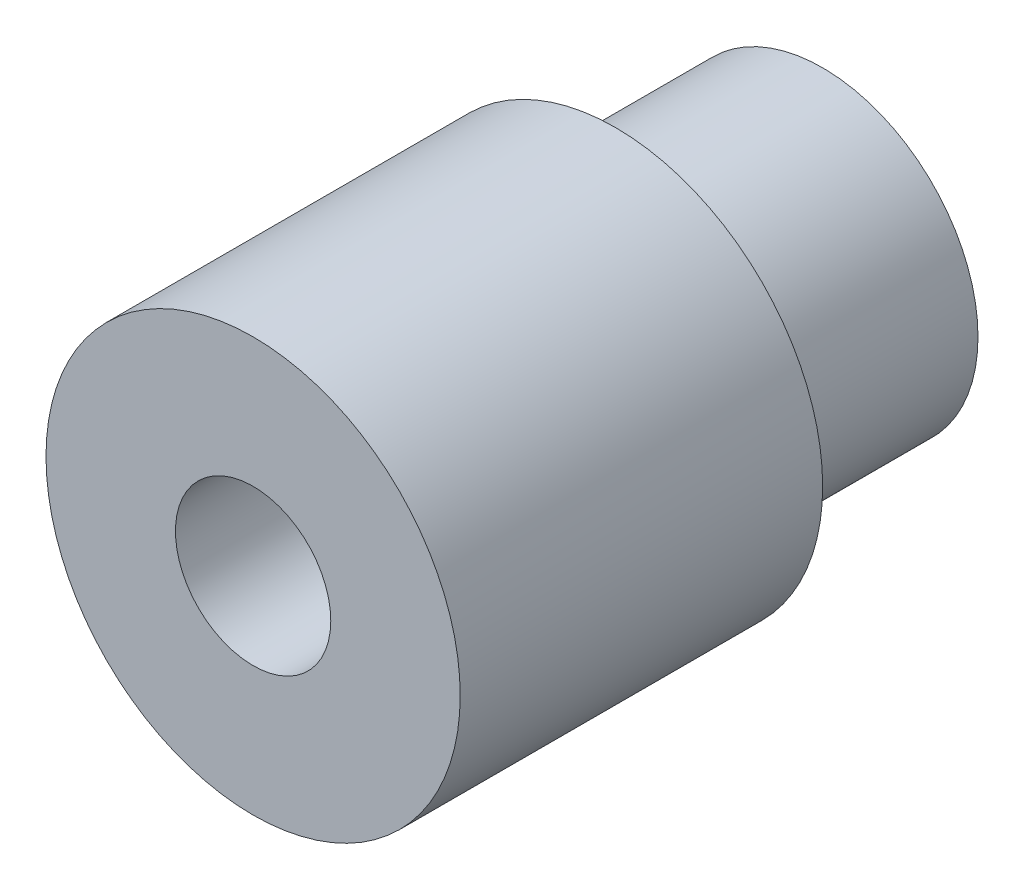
from build123d import *

# Parameters (mm, degrees)
SKETCH1_R          = 8
EXTRUDE1_DEPTH     = 14
SKETCH2_R          = 6
EXTRUDE2_DEPTH     = 8
SKETCH3_R          = 3
CUT_EXTRUDE1_DEPTH = 25.738633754


with BuildPart() as part:
    # Sketch1 → Extrude1 (new body)
    with BuildSketch(Plane.XY):
        with Locations(Location((0, 0, 0), (0, 0, 180))):
            Circle(SKETCH1_R)
    extrude(amount=EXTRUDE1_DEPTH)

    # Sketch2 → Extrude2 (add)
    with BuildSketch(Plane(origin=(0, 0, 0), x_dir=(-1, 0, 0), z_dir=(0, 0, -1))):
        with Locations(Location((0, 0, 0), (0, 0, 180))):
            Circle(SKETCH2_R)
    extrude(amount=EXTRUDE2_DEPTH)

    # Sketch3 → Cut-Extrude1 (cut, through all)
    with BuildSketch(Plane.XY.offset(14)):
        Circle(SKETCH3_R)
    extrude(amount=-CUT_EXTRUDE1_DEPTH, mode=Mode.SUBTRACT)


solid = part.part
